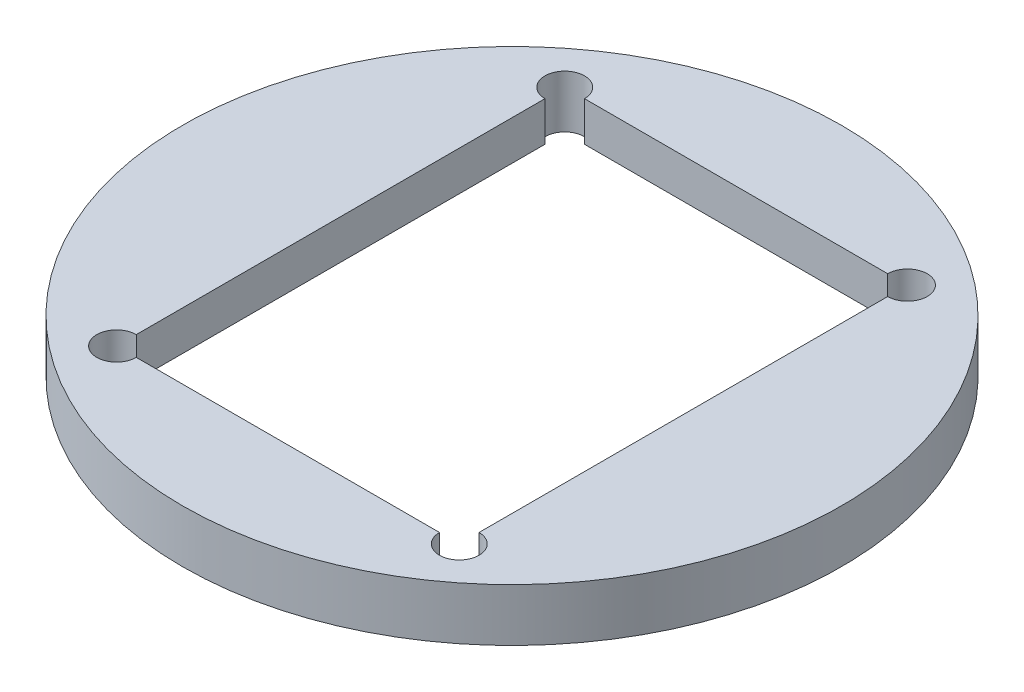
ISO-10303-21;
HEADER;
FILE_DESCRIPTION(('STEP AP214'),'2;1');
FILE_NAME('part.step','',(''),(''),'','','');
FILE_SCHEMA(('AUTOMOTIVE_DESIGN { 1 0 10303 214 1 1 1 1 }'));
ENDSEC;
DATA;
#1=APPLICATION_CONTEXT('core data for automotive mechanical design processes');
#2=APPLICATION_PROTOCOL_DEFINITION('international standard','automotive_design',2000,#1);
#3=PRODUCT_CONTEXT('',#1,'mechanical');
#4=PRODUCT('Part','Part','',(#3));
#5=PRODUCT_RELATED_PRODUCT_CATEGORY('part','',(#4));
#6=PRODUCT_DEFINITION_FORMATION('','',#4);
#7=PRODUCT_DEFINITION_CONTEXT('part definition',#1,'design');
#8=PRODUCT_DEFINITION('design','',#6,#7);
#9=PRODUCT_DEFINITION_SHAPE('','',#8);
#10=(LENGTH_UNIT() NAMED_UNIT(*) SI_UNIT(.MILLI.,.METRE.));
#11=(NAMED_UNIT(*) PLANE_ANGLE_UNIT() SI_UNIT($,.RADIAN.));
#12=(NAMED_UNIT(*) SI_UNIT($,.STERADIAN.) SOLID_ANGLE_UNIT());
#13=UNCERTAINTY_MEASURE_WITH_UNIT(LENGTH_MEASURE(1.E-05),#10,'distance_accuracy_value','');
#14=(GEOMETRIC_REPRESENTATION_CONTEXT(3) GLOBAL_UNCERTAINTY_ASSIGNED_CONTEXT((#13)) GLOBAL_UNIT_ASSIGNED_CONTEXT((#10,
#11,#12)) REPRESENTATION_CONTEXT('',''));
#15=CARTESIAN_POINT('',(0.,0.,0.));
#16=DIRECTION('',(0.,0.,1.));
#17=DIRECTION('',(1.,0.,0.));
#18=AXIS2_PLACEMENT_3D('',#15,#16,#17);
#19=CARTESIAN_POINT('',(0.,0.508,0.));
#20=DIRECTION('',(0.,1.,0.));
#21=DIRECTION('',(0.,0.,1.));
#22=AXIS2_PLACEMENT_3D('',#19,#20,#21);
#23=PLANE('',#22);
#24=CARTESIAN_POINT('',(1.651,0.508,-2.159));
#25=DIRECTION('',(0.,1.,0.));
#26=DIRECTION('',(0.,0.,1.));
#27=AXIS2_PLACEMENT_3D('',#24,#25,#26);
#28=CIRCLE('',#27,0.1905);
#29=CARTESIAN_POINT('',(1.651,0.508,-1.9685));
#30=VERTEX_POINT('',#29);
#31=CARTESIAN_POINT('',(1.4605,0.508,-2.159));
#32=VERTEX_POINT('',#31);
#33=EDGE_CURVE('E139',#30,#32,#28,.T.);
#34=ORIENTED_EDGE('',*,*,#33,.F.);
#35=DIRECTION('',(0.,0.,-1.));
#36=VECTOR('',#35,1.);
#37=CARTESIAN_POINT('',(1.651,0.508,2.159));
#38=LINE('',#37,#36);
#39=CARTESIAN_POINT('',(1.651,0.508,1.9685));
#40=VERTEX_POINT('',#39);
#41=EDGE_CURVE('E205',#40,#30,#38,.T.);
#42=ORIENTED_EDGE('',*,*,#41,.F.);
#43=CARTESIAN_POINT('',(1.651,0.508,2.159));
#44=DIRECTION('',(0.,1.,0.));
#45=DIRECTION('',(0.,0.,1.));
#46=AXIS2_PLACEMENT_3D('',#43,#44,#45);
#47=CIRCLE('',#46,0.1905);
#48=CARTESIAN_POINT('',(1.4605,0.508,2.159));
#49=VERTEX_POINT('',#48);
#50=EDGE_CURVE('E184',#49,#40,#47,.T.);
#51=ORIENTED_EDGE('',*,*,#50,.F.);
#52=DIRECTION('',(1.,0.,0.));
#53=VECTOR('',#52,1.);
#54=CARTESIAN_POINT('',(1.651,0.508,2.159));
#55=LINE('',#54,#53);
#56=CARTESIAN_POINT('',(-1.4605,0.508,2.159));
#57=VERTEX_POINT('',#56);
#58=EDGE_CURVE('E203',#57,#49,#55,.T.);
#59=ORIENTED_EDGE('',*,*,#58,.F.);
#60=CARTESIAN_POINT('',(-1.651,0.508,2.159));
#61=DIRECTION('',(0.,1.,0.));
#62=DIRECTION('',(0.,0.,1.));
#63=AXIS2_PLACEMENT_3D('',#60,#61,#62);
#64=CIRCLE('',#63,0.1905);
#65=CARTESIAN_POINT('',(-1.651,0.508,1.9685));
#66=VERTEX_POINT('',#65);
#67=EDGE_CURVE('E271',#66,#57,#64,.T.);
#68=ORIENTED_EDGE('',*,*,#67,.F.);
#69=DIRECTION('',(0.,0.,1.));
#70=VECTOR('',#69,1.);
#71=CARTESIAN_POINT('',(-1.651,0.508,2.159));
#72=LINE('',#71,#70);
#73=CARTESIAN_POINT('',(-1.651,0.508,-1.9685));
#74=VERTEX_POINT('',#73);
#75=EDGE_CURVE('E201',#74,#66,#72,.T.);
#76=ORIENTED_EDGE('',*,*,#75,.F.);
#77=CARTESIAN_POINT('',(-1.651,0.508,-2.159));
#78=DIRECTION('',(0.,1.,0.));
#79=DIRECTION('',(0.,0.,1.));
#80=AXIS2_PLACEMENT_3D('',#77,#78,#79);
#81=CIRCLE('',#80,0.1905);
#82=CARTESIAN_POINT('',(-1.4605,0.508,-2.159));
#83=VERTEX_POINT('',#82);
#84=EDGE_CURVE('E173',#83,#74,#81,.T.);
#85=ORIENTED_EDGE('',*,*,#84,.F.);
#86=DIRECTION('',(-1.,0.,0.));
#87=VECTOR('',#86,1.);
#88=CARTESIAN_POINT('',(1.651,0.508,-2.159));
#89=LINE('',#88,#87);
#90=EDGE_CURVE('E208',#32,#83,#89,.T.);
#91=ORIENTED_EDGE('',*,*,#90,.F.);
#92=EDGE_LOOP('',(#34,#42,#51,#59,#68,#76,#85,#91));
#93=FACE_BOUND('',#92,.T.);
#94=CARTESIAN_POINT('',(0.,0.508,0.));
#95=DIRECTION('',(0.,1.,0.));
#96=DIRECTION('',(0.,0.,1.));
#97=AXIS2_PLACEMENT_3D('',#94,#95,#96);
#98=CIRCLE('',#97,3.175);
#99=CARTESIAN_POINT('',(0.,0.508,3.175));
#100=VERTEX_POINT('',#99);
#101=EDGE_CURVE('E147',#100,#100,#98,.T.);
#102=ORIENTED_EDGE('',*,*,#101,.T.);
#103=EDGE_LOOP('',(#102));
#104=FACE_BOUND('',#103,.T.);
#105=ADVANCED_FACE('F33',(#93,#104),#23,.T.);
#106=CARTESIAN_POINT('',(0.,0.,0.));
#107=DIRECTION('',(0.,1.,0.));
#108=DIRECTION('',(0.,0.,1.));
#109=AXIS2_PLACEMENT_3D('',#106,#107,#108);
#110=PLANE('',#109);
#111=DIRECTION('',(0.,0.,-1.));
#112=VECTOR('',#111,1.);
#113=CARTESIAN_POINT('',(1.778,0.,-2.159));
#114=LINE('',#113,#112);
#115=CARTESIAN_POINT('',(1.778,0.,2.01700968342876));
#116=VERTEX_POINT('',#115);
#117=CARTESIAN_POINT('',(1.778,0.,-2.01700968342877));
#118=VERTEX_POINT('',#117);
#119=EDGE_CURVE('E138',#116,#118,#114,.T.);
#120=ORIENTED_EDGE('',*,*,#119,.T.);
#121=CARTESIAN_POINT('',(1.651,0.,-2.159));
#122=DIRECTION('',(0.,1.,0.));
#123=DIRECTION('',(0.,0.,1.));
#124=AXIS2_PLACEMENT_3D('',#121,#122,#123);
#125=CIRCLE('',#124,0.1905);
#126=CARTESIAN_POINT('',(1.50900968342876,0.,-2.286));
#127=VERTEX_POINT('',#126);
#128=EDGE_CURVE('E47',#118,#127,#125,.T.);
#129=ORIENTED_EDGE('',*,*,#128,.T.);
#130=DIRECTION('',(-1.,0.,0.));
#131=VECTOR('',#130,1.);
#132=CARTESIAN_POINT('',(-1.651,0.,-2.286));
#133=LINE('',#132,#131);
#134=CARTESIAN_POINT('',(-1.50900968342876,0.,-2.286));
#135=VERTEX_POINT('',#134);
#136=EDGE_CURVE('E134',#127,#135,#133,.T.);
#137=ORIENTED_EDGE('',*,*,#136,.T.);
#138=CARTESIAN_POINT('',(-1.651,0.,-2.159));
#139=DIRECTION('',(0.,1.,0.));
#140=DIRECTION('',(0.,0.,1.));
#141=AXIS2_PLACEMENT_3D('',#138,#139,#140);
#142=CIRCLE('',#141,0.1905);
#143=CARTESIAN_POINT('',(-1.778,0.,-2.01700968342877));
#144=VERTEX_POINT('',#143);
#145=EDGE_CURVE('E167',#135,#144,#142,.T.);
#146=ORIENTED_EDGE('',*,*,#145,.T.);
#147=DIRECTION('',(0.,0.,1.));
#148=VECTOR('',#147,1.);
#149=CARTESIAN_POINT('',(-1.778,0.,2.159));
#150=LINE('',#149,#148);
#151=CARTESIAN_POINT('',(-1.778,0.,2.01700968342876));
#152=VERTEX_POINT('',#151);
#153=EDGE_CURVE('E143',#144,#152,#150,.T.);
#154=ORIENTED_EDGE('',*,*,#153,.T.);
#155=CARTESIAN_POINT('',(-1.651,0.,2.159));
#156=DIRECTION('',(0.,1.,0.));
#157=DIRECTION('',(0.,0.,1.));
#158=AXIS2_PLACEMENT_3D('',#155,#156,#157);
#159=CIRCLE('',#158,0.1905);
#160=CARTESIAN_POINT('',(-1.50900968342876,0.,2.286));
#161=VERTEX_POINT('',#160);
#162=EDGE_CURVE('E186',#152,#161,#159,.T.);
#163=ORIENTED_EDGE('',*,*,#162,.T.);
#164=DIRECTION('',(1.,0.,0.));
#165=VECTOR('',#164,1.);
#166=CARTESIAN_POINT('',(1.651,0.,2.286));
#167=LINE('',#166,#165);
#168=CARTESIAN_POINT('',(1.50900968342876,0.,2.286));
#169=VERTEX_POINT('',#168);
#170=EDGE_CURVE('E145',#161,#169,#167,.T.);
#171=ORIENTED_EDGE('',*,*,#170,.T.);
#172=CARTESIAN_POINT('',(1.651,0.,2.159));
#173=DIRECTION('',(0.,1.,0.));
#174=DIRECTION('',(0.,0.,1.));
#175=AXIS2_PLACEMENT_3D('',#172,#173,#174);
#176=CIRCLE('',#175,0.1905);
#177=EDGE_CURVE('E190',#169,#116,#176,.T.);
#178=ORIENTED_EDGE('',*,*,#177,.T.);
#179=EDGE_LOOP('',(#120,#129,#137,#146,#154,#163,#171,#178));
#180=FACE_BOUND('',#179,.T.);
#181=CARTESIAN_POINT('',(0.,0.,0.));
#182=DIRECTION('',(0.,1.,0.));
#183=DIRECTION('',(0.,0.,1.));
#184=AXIS2_PLACEMENT_3D('',#181,#182,#183);
#185=CIRCLE('',#184,3.175);
#186=CARTESIAN_POINT('',(0.,0.,3.175));
#187=VERTEX_POINT('',#186);
#188=EDGE_CURVE('E210',#187,#187,#185,.T.);
#189=ORIENTED_EDGE('',*,*,#188,.F.);
#190=EDGE_LOOP('',(#189));
#191=FACE_BOUND('',#190,.T.);
#192=ADVANCED_FACE('F131',(#180,#191),#110,.F.);
#193=CARTESIAN_POINT('',(0.,0.508,0.));
#194=DIRECTION('',(0.,-1.,0.));
#195=DIRECTION('',(0.,0.,-1.));
#196=AXIS2_PLACEMENT_3D('',#193,#194,#195);
#197=CYLINDRICAL_SURFACE('',#196,3.175);
#198=ORIENTED_EDGE('',*,*,#101,.F.);
#199=EDGE_LOOP('',(#198));
#200=FACE_BOUND('',#199,.T.);
#201=ORIENTED_EDGE('',*,*,#188,.T.);
#202=EDGE_LOOP('',(#201));
#203=FACE_BOUND('',#202,.T.);
#204=ADVANCED_FACE('F215',(#200,#203),#197,.T.);
#205=CARTESIAN_POINT('',(-1.651,0.508,2.159));
#206=DIRECTION('',(1.,0.,0.));
#207=DIRECTION('',(0.,0.,-1.));
#208=AXIS2_PLACEMENT_3D('',#205,#206,#207);
#209=PLANE('',#208);
#210=DIRECTION('',(0.,1.,0.));
#211=VECTOR('',#210,1.);
#212=CARTESIAN_POINT('',(-1.651,0.,-1.9685));
#213=LINE('',#212,#211);
#214=CARTESIAN_POINT('',(-1.651,0.127000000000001,-1.9685));
#215=VERTEX_POINT('',#214);
#216=EDGE_CURVE('E55',#74,#215,#213,.F.);
#217=ORIENTED_EDGE('',*,*,#216,.F.);
#218=ORIENTED_EDGE('',*,*,#75,.T.);
#219=DIRECTION('',(0.,1.,0.));
#220=VECTOR('',#219,1.);
#221=CARTESIAN_POINT('',(-1.651,0.,1.9685));
#222=LINE('',#221,#220);
#223=CARTESIAN_POINT('',(-1.651,0.127000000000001,1.9685));
#224=VERTEX_POINT('',#223);
#225=EDGE_CURVE('E181',#224,#66,#222,.T.);
#226=ORIENTED_EDGE('',*,*,#225,.F.);
#227=DIRECTION('',(0.,0.,-1.));
#228=VECTOR('',#227,1.);
#229=CARTESIAN_POINT('',(-1.651,0.127000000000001,-2.159));
#230=LINE('',#229,#228);
#231=EDGE_CURVE('E159',#224,#215,#230,.T.);
#232=ORIENTED_EDGE('',*,*,#231,.T.);
#233=EDGE_LOOP('',(#217,#218,#226,#232));
#234=FACE_BOUND('',#233,.T.);
#235=ADVANCED_FACE('F222',(#234),#209,.T.);
#236=CARTESIAN_POINT('',(1.651,0.508,2.159));
#237=DIRECTION('',(0.,0.,-1.));
#238=DIRECTION('',(-1.,0.,0.));
#239=AXIS2_PLACEMENT_3D('',#236,#237,#238);
#240=PLANE('',#239);
#241=DIRECTION('',(0.,1.,0.));
#242=VECTOR('',#241,1.);
#243=CARTESIAN_POINT('',(-1.4605,0.,2.159));
#244=LINE('',#243,#242);
#245=CARTESIAN_POINT('',(-1.4605,0.127000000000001,2.159));
#246=VERTEX_POINT('',#245);
#247=EDGE_CURVE('E182',#57,#246,#244,.F.);
#248=ORIENTED_EDGE('',*,*,#247,.F.);
#249=ORIENTED_EDGE('',*,*,#58,.T.);
#250=DIRECTION('',(0.,1.,0.));
#251=VECTOR('',#250,1.);
#252=CARTESIAN_POINT('',(1.4605,0.,2.159));
#253=LINE('',#252,#251);
#254=CARTESIAN_POINT('',(1.4605,0.127000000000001,2.159));
#255=VERTEX_POINT('',#254);
#256=EDGE_CURVE('E192',#255,#49,#253,.T.);
#257=ORIENTED_EDGE('',*,*,#256,.F.);
#258=DIRECTION('',(-1.,0.,0.));
#259=VECTOR('',#258,1.);
#260=CARTESIAN_POINT('',(-1.651,0.127000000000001,2.159));
#261=LINE('',#260,#259);
#262=EDGE_CURVE('E152',#255,#246,#261,.T.);
#263=ORIENTED_EDGE('',*,*,#262,.T.);
#264=EDGE_LOOP('',(#248,#249,#257,#263));
#265=FACE_BOUND('',#264,.T.);
#266=ADVANCED_FACE('F251',(#265),#240,.T.);
#267=CARTESIAN_POINT('',(1.651,0.508,2.159));
#268=DIRECTION('',(-1.,0.,0.));
#269=DIRECTION('',(0.,0.,1.));
#270=AXIS2_PLACEMENT_3D('',#267,#268,#269);
#271=PLANE('',#270);
#272=DIRECTION('',(0.,1.,0.));
#273=VECTOR('',#272,1.);
#274=CARTESIAN_POINT('',(1.651,0.,-1.9685));
#275=LINE('',#274,#273);
#276=CARTESIAN_POINT('',(1.651,0.127000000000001,-1.9685));
#277=VERTEX_POINT('',#276);
#278=EDGE_CURVE('E127',#277,#30,#275,.T.);
#279=ORIENTED_EDGE('',*,*,#278,.F.);
#280=DIRECTION('',(0.,0.,1.));
#281=VECTOR('',#280,1.);
#282=CARTESIAN_POINT('',(1.651,0.127000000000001,2.159));
#283=LINE('',#282,#281);
#284=CARTESIAN_POINT('',(1.651,0.127000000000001,1.9685));
#285=VERTEX_POINT('',#284);
#286=EDGE_CURVE('E155',#277,#285,#283,.T.);
#287=ORIENTED_EDGE('',*,*,#286,.T.);
#288=DIRECTION('',(0.,1.,0.));
#289=VECTOR('',#288,1.);
#290=CARTESIAN_POINT('',(1.651,0.,1.9685));
#291=LINE('',#290,#289);
#292=EDGE_CURVE('E198',#40,#285,#291,.F.);
#293=ORIENTED_EDGE('',*,*,#292,.F.);
#294=ORIENTED_EDGE('',*,*,#41,.T.);
#295=EDGE_LOOP('',(#279,#287,#293,#294));
#296=FACE_BOUND('',#295,.T.);
#297=ADVANCED_FACE('F245',(#296),#271,.T.);
#298=CARTESIAN_POINT('',(1.651,0.508,-2.159));
#299=DIRECTION('',(0.,0.,1.));
#300=DIRECTION('',(1.,0.,0.));
#301=AXIS2_PLACEMENT_3D('',#298,#299,#300);
#302=PLANE('',#301);
#303=DIRECTION('',(0.,1.,0.));
#304=VECTOR('',#303,1.);
#305=CARTESIAN_POINT('',(1.4605,0.,-2.159));
#306=LINE('',#305,#304);
#307=CARTESIAN_POINT('',(1.4605,0.127000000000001,-2.159));
#308=VERTEX_POINT('',#307);
#309=EDGE_CURVE('E122',#32,#308,#306,.F.);
#310=ORIENTED_EDGE('',*,*,#309,.F.);
#311=ORIENTED_EDGE('',*,*,#90,.T.);
#312=DIRECTION('',(0.,1.,0.));
#313=VECTOR('',#312,1.);
#314=CARTESIAN_POINT('',(-1.4605,0.,-2.159));
#315=LINE('',#314,#313);
#316=CARTESIAN_POINT('',(-1.4605,0.127000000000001,-2.159));
#317=VERTEX_POINT('',#316);
#318=EDGE_CURVE('E274',#317,#83,#315,.T.);
#319=ORIENTED_EDGE('',*,*,#318,.F.);
#320=DIRECTION('',(1.,0.,0.));
#321=VECTOR('',#320,1.);
#322=CARTESIAN_POINT('',(1.651,0.127000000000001,-2.159));
#323=LINE('',#322,#321);
#324=EDGE_CURVE('E157',#317,#308,#323,.T.);
#325=ORIENTED_EDGE('',*,*,#324,.T.);
#326=EDGE_LOOP('',(#310,#311,#319,#325));
#327=FACE_BOUND('',#326,.T.);
#328=ADVANCED_FACE('F241',(#327),#302,.T.);
#329=CARTESIAN_POINT('',(0.,0.,-2.286));
#330=DIRECTION('',(0.,-0.707106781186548,0.707106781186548));
#331=DIRECTION('',(0.,-0.707106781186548,-0.707106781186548));
#332=AXIS2_PLACEMENT_3D('',#329,#330,#331);
#333=PLANE('',#332);
#334=CARTESIAN_POINT('',(1.651,0.127000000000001,-2.159));
#335=DIRECTION('',(0.,-0.707106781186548,0.707106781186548));
#336=DIRECTION('',(0.,0.707106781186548,0.707106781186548));
#337=AXIS2_PLACEMENT_3D('',#334,#335,#336);
#338=ELLIPSE('',#337,0.269407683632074,0.1905);
#339=EDGE_CURVE('E119',#308,#127,#338,.T.);
#340=ORIENTED_EDGE('',*,*,#339,.F.);
#341=ORIENTED_EDGE('',*,*,#324,.F.);
#342=CARTESIAN_POINT('',(-1.651,0.127000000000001,-2.159));
#343=DIRECTION('',(0.,-0.707106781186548,0.707106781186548));
#344=DIRECTION('',(0.,0.707106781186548,0.707106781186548));
#345=AXIS2_PLACEMENT_3D('',#342,#343,#344);
#346=ELLIPSE('',#345,0.269407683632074,0.1905);
#347=EDGE_CURVE('E142',#135,#317,#346,.T.);
#348=ORIENTED_EDGE('',*,*,#347,.F.);
#349=ORIENTED_EDGE('',*,*,#136,.F.);
#350=EDGE_LOOP('',(#340,#341,#348,#349));
#351=FACE_BOUND('',#350,.T.);
#352=ADVANCED_FACE('F35',(#351),#333,.T.);
#353=CARTESIAN_POINT('',(-1.778,0.,0.));
#354=DIRECTION('',(0.707106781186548,-0.707106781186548,0.));
#355=DIRECTION('',(0.707106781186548,0.707106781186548,0.));
#356=AXIS2_PLACEMENT_3D('',#353,#354,#355);
#357=PLANE('',#356);
#358=CARTESIAN_POINT('',(-1.651,0.127000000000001,-2.159));
#359=DIRECTION('',(0.707106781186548,-0.707106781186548,0.));
#360=DIRECTION('',(0.707106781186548,0.707106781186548,0.));
#361=AXIS2_PLACEMENT_3D('',#358,#359,#360);
#362=ELLIPSE('',#361,0.269407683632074,0.1905);
#363=EDGE_CURVE('E41',#215,#144,#362,.T.);
#364=ORIENTED_EDGE('',*,*,#363,.F.);
#365=ORIENTED_EDGE('',*,*,#231,.F.);
#366=CARTESIAN_POINT('',(-1.651,0.127000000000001,2.159));
#367=DIRECTION('',(0.707106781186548,-0.707106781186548,0.));
#368=DIRECTION('',(0.707106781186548,0.707106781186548,0.));
#369=AXIS2_PLACEMENT_3D('',#366,#367,#368);
#370=ELLIPSE('',#369,0.269407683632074,0.1905);
#371=EDGE_CURVE('E177',#152,#224,#370,.T.);
#372=ORIENTED_EDGE('',*,*,#371,.F.);
#373=ORIENTED_EDGE('',*,*,#153,.F.);
#374=EDGE_LOOP('',(#364,#365,#372,#373));
#375=FACE_BOUND('',#374,.T.);
#376=ADVANCED_FACE('F176',(#375),#357,.T.);
#377=CARTESIAN_POINT('',(1.778,0.,0.));
#378=DIRECTION('',(-0.707106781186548,-0.707106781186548,0.));
#379=DIRECTION('',(0.707106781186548,-0.707106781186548,0.));
#380=AXIS2_PLACEMENT_3D('',#377,#378,#379);
#381=PLANE('',#380);
#382=CARTESIAN_POINT('',(1.651,0.127000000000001,-2.159));
#383=DIRECTION('',(-0.707106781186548,-0.707106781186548,0.));
#384=DIRECTION('',(-0.707106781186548,0.707106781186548,0.));
#385=AXIS2_PLACEMENT_3D('',#382,#383,#384);
#386=ELLIPSE('',#385,0.269407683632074,0.1905);
#387=EDGE_CURVE('E11',#118,#277,#386,.T.);
#388=ORIENTED_EDGE('',*,*,#387,.F.);
#389=ORIENTED_EDGE('',*,*,#119,.F.);
#390=CARTESIAN_POINT('',(1.651,0.127000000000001,2.159));
#391=DIRECTION('',(-0.707106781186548,-0.707106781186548,0.));
#392=DIRECTION('',(-0.707106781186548,0.707106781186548,0.));
#393=AXIS2_PLACEMENT_3D('',#390,#391,#392);
#394=ELLIPSE('',#393,0.269407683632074,0.1905);
#395=EDGE_CURVE('E196',#285,#116,#394,.T.);
#396=ORIENTED_EDGE('',*,*,#395,.F.);
#397=ORIENTED_EDGE('',*,*,#286,.F.);
#398=EDGE_LOOP('',(#388,#389,#396,#397));
#399=FACE_BOUND('',#398,.T.);
#400=ADVANCED_FACE('F233',(#399),#381,.T.);
#401=CARTESIAN_POINT('',(0.,0.,2.286));
#402=DIRECTION('',(0.,-0.707106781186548,-0.707106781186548));
#403=DIRECTION('',(0.,0.707106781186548,-0.707106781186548));
#404=AXIS2_PLACEMENT_3D('',#401,#402,#403);
#405=PLANE('',#404);
#406=CARTESIAN_POINT('',(-1.651,0.127000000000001,2.159));
#407=DIRECTION('',(0.,-0.707106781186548,-0.707106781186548));
#408=DIRECTION('',(0.,0.707106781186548,-0.707106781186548));
#409=AXIS2_PLACEMENT_3D('',#406,#407,#408);
#410=ELLIPSE('',#409,0.269407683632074,0.1905);
#411=EDGE_CURVE('E164',#246,#161,#410,.T.);
#412=ORIENTED_EDGE('',*,*,#411,.F.);
#413=ORIENTED_EDGE('',*,*,#262,.F.);
#414=CARTESIAN_POINT('',(1.651,0.127000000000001,2.159));
#415=DIRECTION('',(0.,-0.707106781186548,-0.707106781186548));
#416=DIRECTION('',(0.,0.707106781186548,-0.707106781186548));
#417=AXIS2_PLACEMENT_3D('',#414,#415,#416);
#418=ELLIPSE('',#417,0.269407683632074,0.1905);
#419=EDGE_CURVE('E162',#169,#255,#418,.T.);
#420=ORIENTED_EDGE('',*,*,#419,.F.);
#421=ORIENTED_EDGE('',*,*,#170,.F.);
#422=EDGE_LOOP('',(#412,#413,#420,#421));
#423=FACE_BOUND('',#422,.T.);
#424=ADVANCED_FACE('F229',(#423),#405,.T.);
#425=CARTESIAN_POINT('',(1.651,0.,2.159));
#426=DIRECTION('',(0.,1.,0.));
#427=DIRECTION('',(0.,0.,1.));
#428=AXIS2_PLACEMENT_3D('',#425,#426,#427);
#429=CYLINDRICAL_SURFACE('',#428,0.1905);
#430=ORIENTED_EDGE('',*,*,#292,.T.);
#431=ORIENTED_EDGE('',*,*,#395,.T.);
#432=ORIENTED_EDGE('',*,*,#177,.F.);
#433=ORIENTED_EDGE('',*,*,#419,.T.);
#434=ORIENTED_EDGE('',*,*,#256,.T.);
#435=ORIENTED_EDGE('',*,*,#50,.T.);
#436=EDGE_LOOP('',(#430,#431,#432,#433,#434,#435));
#437=FACE_BOUND('',#436,.T.);
#438=ADVANCED_FACE('F232',(#437),#429,.F.);
#439=CARTESIAN_POINT('',(-1.651,0.,2.159));
#440=DIRECTION('',(0.,1.,0.));
#441=DIRECTION('',(0.,0.,1.));
#442=AXIS2_PLACEMENT_3D('',#439,#440,#441);
#443=CYLINDRICAL_SURFACE('',#442,0.1905);
#444=ORIENTED_EDGE('',*,*,#225,.T.);
#445=ORIENTED_EDGE('',*,*,#67,.T.);
#446=ORIENTED_EDGE('',*,*,#247,.T.);
#447=ORIENTED_EDGE('',*,*,#411,.T.);
#448=ORIENTED_EDGE('',*,*,#162,.F.);
#449=ORIENTED_EDGE('',*,*,#371,.T.);
#450=EDGE_LOOP('',(#444,#445,#446,#447,#448,#449));
#451=FACE_BOUND('',#450,.T.);
#452=ADVANCED_FACE('F295',(#451),#443,.F.);
#453=CARTESIAN_POINT('',(-1.651,0.,-2.159));
#454=DIRECTION('',(0.,1.,0.));
#455=DIRECTION('',(0.,0.,1.));
#456=AXIS2_PLACEMENT_3D('',#453,#454,#455);
#457=CYLINDRICAL_SURFACE('',#456,0.1905);
#458=ORIENTED_EDGE('',*,*,#318,.T.);
#459=ORIENTED_EDGE('',*,*,#84,.T.);
#460=ORIENTED_EDGE('',*,*,#216,.T.);
#461=ORIENTED_EDGE('',*,*,#363,.T.);
#462=ORIENTED_EDGE('',*,*,#145,.F.);
#463=ORIENTED_EDGE('',*,*,#347,.T.);
#464=EDGE_LOOP('',(#458,#459,#460,#461,#462,#463));
#465=FACE_BOUND('',#464,.T.);
#466=ADVANCED_FACE('F166',(#465),#457,.F.);
#467=CARTESIAN_POINT('',(1.651,0.,-2.159));
#468=DIRECTION('',(0.,1.,0.));
#469=DIRECTION('',(0.,0.,1.));
#470=AXIS2_PLACEMENT_3D('',#467,#468,#469);
#471=CYLINDRICAL_SURFACE('',#470,0.1905);
#472=ORIENTED_EDGE('',*,*,#309,.T.);
#473=ORIENTED_EDGE('',*,*,#339,.T.);
#474=ORIENTED_EDGE('',*,*,#128,.F.);
#475=ORIENTED_EDGE('',*,*,#387,.T.);
#476=ORIENTED_EDGE('',*,*,#278,.T.);
#477=ORIENTED_EDGE('',*,*,#33,.T.);
#478=EDGE_LOOP('',(#472,#473,#474,#475,#476,#477));
#479=FACE_BOUND('',#478,.T.);
#480=ADVANCED_FACE('F120',(#479),#471,.F.);
#481=CLOSED_SHELL('',(#105,#192,#204,#235,#266,#297,#328,#352,#376,#400,#424,#438,#452,#466,#480));
#482=MANIFOLD_SOLID_BREP('B2',#481);
#483=ADVANCED_BREP_SHAPE_REPRESENTATION('',(#18,#482),#14);
#484=SHAPE_DEFINITION_REPRESENTATION(#9,#483);
ENDSEC;
END-ISO-10303-21;
